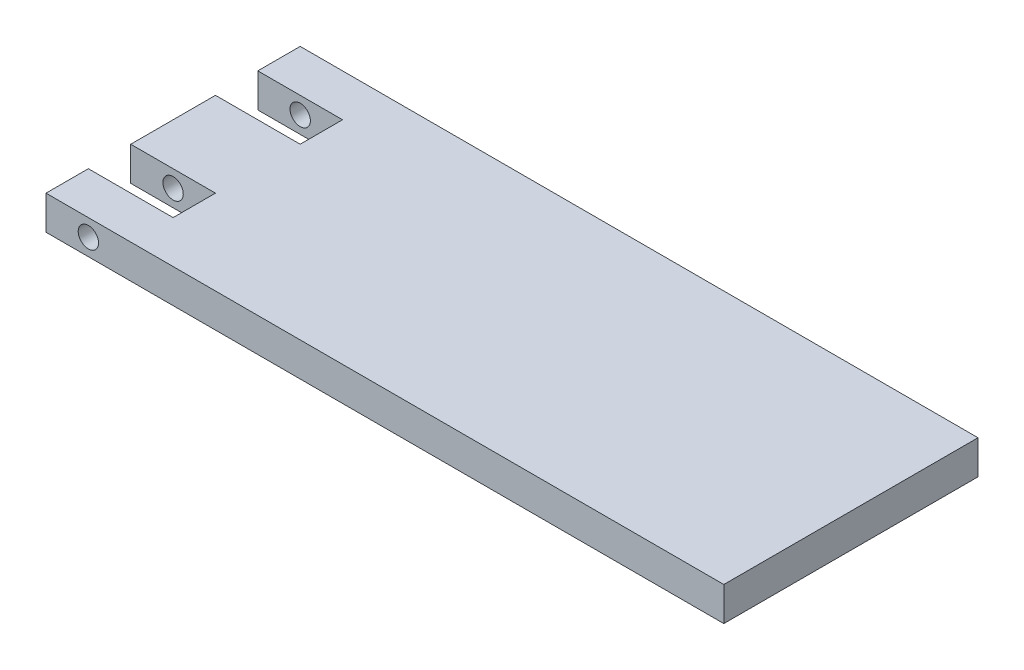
ISO-10303-21;
HEADER;
FILE_DESCRIPTION(('STEP AP214'),'2;1');
FILE_NAME('part.step','',(''),(''),'','','');
FILE_SCHEMA(('AUTOMOTIVE_DESIGN { 1 0 10303 214 1 1 1 1 }'));
ENDSEC;
DATA;
#1=APPLICATION_CONTEXT('core data for automotive mechanical design processes');
#2=APPLICATION_PROTOCOL_DEFINITION('international standard','automotive_design',2000,#1);
#3=PRODUCT_CONTEXT('',#1,'mechanical');
#4=PRODUCT('Part','Part','',(#3));
#5=PRODUCT_RELATED_PRODUCT_CATEGORY('part','',(#4));
#6=PRODUCT_DEFINITION_FORMATION('','',#4);
#7=PRODUCT_DEFINITION_CONTEXT('part definition',#1,'design');
#8=PRODUCT_DEFINITION('design','',#6,#7);
#9=PRODUCT_DEFINITION_SHAPE('','',#8);
#10=(LENGTH_UNIT() NAMED_UNIT(*) SI_UNIT(.MILLI.,.METRE.));
#11=(NAMED_UNIT(*) PLANE_ANGLE_UNIT() SI_UNIT($,.RADIAN.));
#12=(NAMED_UNIT(*) SI_UNIT($,.STERADIAN.) SOLID_ANGLE_UNIT());
#13=UNCERTAINTY_MEASURE_WITH_UNIT(LENGTH_MEASURE(1.E-05),#10,'distance_accuracy_value','');
#14=(GEOMETRIC_REPRESENTATION_CONTEXT(3) GLOBAL_UNCERTAINTY_ASSIGNED_CONTEXT((#13)) GLOBAL_UNIT_ASSIGNED_CONTEXT((#10,
#11,#12)) REPRESENTATION_CONTEXT('',''));
#15=CARTESIAN_POINT('',(0.,0.,0.));
#16=DIRECTION('',(0.,0.,1.));
#17=DIRECTION('',(1.,0.,0.));
#18=AXIS2_PLACEMENT_3D('',#15,#16,#17);
#19=CARTESIAN_POINT('',(0.,20.,-75.));
#20=DIRECTION('',(1.,0.,0.));
#21=DIRECTION('',(0.,0.,-1.));
#22=AXIS2_PLACEMENT_3D('',#19,#20,#21);
#23=PLANE('',#22);
#24=DIRECTION('',(0.,1.,0.));
#25=VECTOR('',#24,1.);
#26=CARTESIAN_POINT('',(0.,0.,25.));
#27=LINE('',#26,#25);
#28=CARTESIAN_POINT('',(0.,0.,25.));
#29=VERTEX_POINT('',#28);
#30=CARTESIAN_POINT('',(0.,20.,25.));
#31=VERTEX_POINT('',#30);
#32=EDGE_CURVE('E216',#29,#31,#27,.T.);
#33=ORIENTED_EDGE('',*,*,#32,.T.);
#34=DIRECTION('',(0.,0.,1.));
#35=VECTOR('',#34,1.);
#36=CARTESIAN_POINT('',(0.,20.,-75.));
#37=LINE('',#36,#35);
#38=CARTESIAN_POINT('',(0.,20.,-25.));
#39=VERTEX_POINT('',#38);
#40=EDGE_CURVE('E192',#39,#31,#37,.T.);
#41=ORIENTED_EDGE('',*,*,#40,.F.);
#42=DIRECTION('',(0.,1.,0.));
#43=VECTOR('',#42,1.);
#44=CARTESIAN_POINT('',(0.,0.,-25.));
#45=LINE('',#44,#43);
#46=CARTESIAN_POINT('',(0.,0.,-25.));
#47=VERTEX_POINT('',#46);
#48=EDGE_CURVE('E241',#47,#39,#45,.T.);
#49=ORIENTED_EDGE('',*,*,#48,.F.);
#50=DIRECTION('',(0.,0.,1.));
#51=VECTOR('',#50,1.);
#52=CARTESIAN_POINT('',(0.,0.,-75.));
#53=LINE('',#52,#51);
#54=EDGE_CURVE('E145',#47,#29,#53,.T.);
#55=ORIENTED_EDGE('',*,*,#54,.T.);
#56=EDGE_LOOP('',(#33,#41,#49,#55));
#57=FACE_BOUND('',#56,.T.);
#58=ADVANCED_FACE('F34',(#57),#23,.F.);
#59=DIRECTION('',(0.,1.,0.));
#60=VECTOR('',#59,1.);
#61=CARTESIAN_POINT('',(0.,0.,50.));
#62=LINE('',#61,#60);
#63=CARTESIAN_POINT('',(0.,0.,50.));
#64=VERTEX_POINT('',#63);
#65=CARTESIAN_POINT('',(0.,20.,50.));
#66=VERTEX_POINT('',#65);
#67=EDGE_CURVE('E124',#64,#66,#62,.T.);
#68=ORIENTED_EDGE('',*,*,#67,.F.);
#69=CARTESIAN_POINT('',(0.,0.,75.));
#70=VERTEX_POINT('',#69);
#71=EDGE_CURVE('E136',#64,#70,#53,.T.);
#72=ORIENTED_EDGE('',*,*,#71,.T.);
#73=DIRECTION('',(0.,-1.,0.));
#74=VECTOR('',#73,1.);
#75=CARTESIAN_POINT('',(0.,20.,75.));
#76=LINE('',#75,#74);
#77=CARTESIAN_POINT('',(0.,20.,75.));
#78=VERTEX_POINT('',#77);
#79=EDGE_CURVE('E11',#78,#70,#76,.T.);
#80=ORIENTED_EDGE('',*,*,#79,.F.);
#81=EDGE_CURVE('E138',#66,#78,#37,.T.);
#82=ORIENTED_EDGE('',*,*,#81,.F.);
#83=EDGE_LOOP('',(#68,#72,#80,#82));
#84=FACE_BOUND('',#83,.T.);
#85=ADVANCED_FACE('F134',(#84),#23,.F.);
#86=CARTESIAN_POINT('',(0.,20.,75.));
#87=DIRECTION('',(0.,1.,0.));
#88=DIRECTION('',(0.,0.,1.));
#89=AXIS2_PLACEMENT_3D('',#86,#87,#88);
#90=PLANE('',#89);
#91=ORIENTED_EDGE('',*,*,#40,.T.);
#92=DIRECTION('',(1.,0.,0.));
#93=VECTOR('',#92,1.);
#94=CARTESIAN_POINT('',(0.,20.,25.));
#95=LINE('',#94,#93);
#96=CARTESIAN_POINT('',(50.,20.,25.));
#97=VERTEX_POINT('',#96);
#98=EDGE_CURVE('E130',#31,#97,#95,.T.);
#99=ORIENTED_EDGE('',*,*,#98,.T.);
#100=DIRECTION('',(0.,0.,1.));
#101=VECTOR('',#100,1.);
#102=CARTESIAN_POINT('',(50.,20.,50.));
#103=LINE('',#102,#101);
#104=CARTESIAN_POINT('',(50.,20.,50.));
#105=VERTEX_POINT('',#104);
#106=EDGE_CURVE('E249',#97,#105,#103,.T.);
#107=ORIENTED_EDGE('',*,*,#106,.T.);
#108=DIRECTION('',(-1.,0.,0.));
#109=VECTOR('',#108,1.);
#110=CARTESIAN_POINT('',(0.,20.,50.));
#111=LINE('',#110,#109);
#112=EDGE_CURVE('E199',#105,#66,#111,.T.);
#113=ORIENTED_EDGE('',*,*,#112,.T.);
#114=ORIENTED_EDGE('',*,*,#81,.T.);
#115=DIRECTION('',(1.,0.,0.));
#116=VECTOR('',#115,1.);
#117=CARTESIAN_POINT('',(0.,20.,75.));
#118=LINE('',#117,#116);
#119=CARTESIAN_POINT('',(400.,20.,75.));
#120=VERTEX_POINT('',#119);
#121=EDGE_CURVE('E191',#78,#120,#118,.T.);
#122=ORIENTED_EDGE('',*,*,#121,.T.);
#123=DIRECTION('',(0.,0.,-1.));
#124=VECTOR('',#123,1.);
#125=CARTESIAN_POINT('',(400.,20.,-75.));
#126=LINE('',#125,#124);
#127=CARTESIAN_POINT('',(400.,20.,-75.));
#128=VERTEX_POINT('',#127);
#129=EDGE_CURVE('E177',#120,#128,#126,.T.);
#130=ORIENTED_EDGE('',*,*,#129,.T.);
#131=DIRECTION('',(-1.,0.,0.));
#132=VECTOR('',#131,1.);
#133=CARTESIAN_POINT('',(0.,20.,-75.));
#134=LINE('',#133,#132);
#135=CARTESIAN_POINT('',(0.,20.,-75.));
#136=VERTEX_POINT('',#135);
#137=EDGE_CURVE('E170',#128,#136,#134,.T.);
#138=ORIENTED_EDGE('',*,*,#137,.T.);
#139=CARTESIAN_POINT('',(0.,20.,-50.));
#140=VERTEX_POINT('',#139);
#141=EDGE_CURVE('E188',#136,#140,#37,.T.);
#142=ORIENTED_EDGE('',*,*,#141,.T.);
#143=DIRECTION('',(-1.,0.,0.));
#144=VECTOR('',#143,1.);
#145=CARTESIAN_POINT('',(0.,20.,-50.));
#146=LINE('',#145,#144);
#147=CARTESIAN_POINT('',(50.,20.,-50.));
#148=VERTEX_POINT('',#147);
#149=EDGE_CURVE('E231',#148,#140,#146,.T.);
#150=ORIENTED_EDGE('',*,*,#149,.F.);
#151=DIRECTION('',(0.,0.,-1.));
#152=VECTOR('',#151,1.);
#153=CARTESIAN_POINT('',(50.,20.,-50.));
#154=LINE('',#153,#152);
#155=CARTESIAN_POINT('',(50.,20.,-25.));
#156=VERTEX_POINT('',#155);
#157=EDGE_CURVE('E228',#156,#148,#154,.T.);
#158=ORIENTED_EDGE('',*,*,#157,.F.);
#159=DIRECTION('',(1.,0.,0.));
#160=VECTOR('',#159,1.);
#161=CARTESIAN_POINT('',(0.,20.,-25.));
#162=LINE('',#161,#160);
#163=EDGE_CURVE('E220',#39,#156,#162,.T.);
#164=ORIENTED_EDGE('',*,*,#163,.F.);
#165=EDGE_LOOP('',(#91,#99,#107,#113,#114,#122,#130,#138,#142,#150,#158,#164));
#166=FACE_BOUND('',#165,.T.);
#167=ADVANCED_FACE('F197',(#166),#90,.T.);
#168=CARTESIAN_POINT('',(0.,0.,75.));
#169=DIRECTION('',(0.,1.,0.));
#170=DIRECTION('',(0.,0.,1.));
#171=AXIS2_PLACEMENT_3D('',#168,#169,#170);
#172=PLANE('',#171);
#173=DIRECTION('',(1.,0.,0.));
#174=VECTOR('',#173,1.);
#175=CARTESIAN_POINT('',(0.,0.,25.));
#176=LINE('',#175,#174);
#177=CARTESIAN_POINT('',(50.,0.,25.));
#178=VERTEX_POINT('',#177);
#179=EDGE_CURVE('E139',#29,#178,#176,.T.);
#180=ORIENTED_EDGE('',*,*,#179,.F.);
#181=ORIENTED_EDGE('',*,*,#54,.F.);
#182=DIRECTION('',(1.,0.,0.));
#183=VECTOR('',#182,1.);
#184=CARTESIAN_POINT('',(0.,0.,-25.));
#185=LINE('',#184,#183);
#186=CARTESIAN_POINT('',(50.,0.,-25.));
#187=VERTEX_POINT('',#186);
#188=EDGE_CURVE('E237',#47,#187,#185,.T.);
#189=ORIENTED_EDGE('',*,*,#188,.T.);
#190=DIRECTION('',(0.,0.,-1.));
#191=VECTOR('',#190,1.);
#192=CARTESIAN_POINT('',(50.,0.,-50.));
#193=LINE('',#192,#191);
#194=CARTESIAN_POINT('',(50.,0.,-50.));
#195=VERTEX_POINT('',#194);
#196=EDGE_CURVE('E57',#187,#195,#193,.T.);
#197=ORIENTED_EDGE('',*,*,#196,.T.);
#198=DIRECTION('',(-1.,0.,0.));
#199=VECTOR('',#198,1.);
#200=CARTESIAN_POINT('',(0.,0.,-50.));
#201=LINE('',#200,#199);
#202=CARTESIAN_POINT('',(0.,0.,-50.));
#203=VERTEX_POINT('',#202);
#204=EDGE_CURVE('E234',#195,#203,#201,.T.);
#205=ORIENTED_EDGE('',*,*,#204,.T.);
#206=CARTESIAN_POINT('',(0.,0.,-75.));
#207=VERTEX_POINT('',#206);
#208=EDGE_CURVE('E148',#207,#203,#53,.T.);
#209=ORIENTED_EDGE('',*,*,#208,.F.);
#210=DIRECTION('',(-1.,0.,0.));
#211=VECTOR('',#210,1.);
#212=CARTESIAN_POINT('',(0.,0.,-75.));
#213=LINE('',#212,#211);
#214=CARTESIAN_POINT('',(400.,0.,-75.));
#215=VERTEX_POINT('',#214);
#216=EDGE_CURVE('E163',#215,#207,#213,.T.);
#217=ORIENTED_EDGE('',*,*,#216,.F.);
#218=DIRECTION('',(0.,0.,-1.));
#219=VECTOR('',#218,1.);
#220=CARTESIAN_POINT('',(400.,0.,-75.));
#221=LINE('',#220,#219);
#222=CARTESIAN_POINT('',(400.,0.,75.));
#223=VERTEX_POINT('',#222);
#224=EDGE_CURVE('E159',#223,#215,#221,.T.);
#225=ORIENTED_EDGE('',*,*,#224,.F.);
#226=DIRECTION('',(1.,0.,0.));
#227=VECTOR('',#226,1.);
#228=CARTESIAN_POINT('',(0.,0.,75.));
#229=LINE('',#228,#227);
#230=EDGE_CURVE('E144',#70,#223,#229,.T.);
#231=ORIENTED_EDGE('',*,*,#230,.F.);
#232=ORIENTED_EDGE('',*,*,#71,.F.);
#233=DIRECTION('',(-1.,0.,0.));
#234=VECTOR('',#233,1.);
#235=CARTESIAN_POINT('',(0.,0.,50.));
#236=LINE('',#235,#234);
#237=CARTESIAN_POINT('',(50.,0.,50.));
#238=VERTEX_POINT('',#237);
#239=EDGE_CURVE('E121',#238,#64,#236,.T.);
#240=ORIENTED_EDGE('',*,*,#239,.F.);
#241=DIRECTION('',(0.,0.,1.));
#242=VECTOR('',#241,1.);
#243=CARTESIAN_POINT('',(50.,0.,50.));
#244=LINE('',#243,#242);
#245=EDGE_CURVE('E129',#178,#238,#244,.T.);
#246=ORIENTED_EDGE('',*,*,#245,.F.);
#247=EDGE_LOOP('',(#180,#181,#189,#197,#205,#209,#217,#225,#231,#232,#240,#246));
#248=FACE_BOUND('',#247,.T.);
#249=ADVANCED_FACE('F142',(#248),#172,.F.);
#250=ORIENTED_EDGE('',*,*,#208,.T.);
#251=DIRECTION('',(0.,1.,0.));
#252=VECTOR('',#251,1.);
#253=CARTESIAN_POINT('',(0.,0.,-50.));
#254=LINE('',#253,#252);
#255=EDGE_CURVE('E146',#203,#140,#254,.T.);
#256=ORIENTED_EDGE('',*,*,#255,.T.);
#257=ORIENTED_EDGE('',*,*,#141,.F.);
#258=DIRECTION('',(0.,-1.,0.));
#259=VECTOR('',#258,1.);
#260=CARTESIAN_POINT('',(0.,20.,-75.));
#261=LINE('',#260,#259);
#262=EDGE_CURVE('E167',#136,#207,#261,.T.);
#263=ORIENTED_EDGE('',*,*,#262,.T.);
#264=EDGE_LOOP('',(#250,#256,#257,#263));
#265=FACE_BOUND('',#264,.T.);
#266=ADVANCED_FACE('F186',(#265),#23,.F.);
#267=CARTESIAN_POINT('',(0.,20.,75.));
#268=DIRECTION('',(0.,0.,-1.));
#269=DIRECTION('',(-1.,0.,0.));
#270=AXIS2_PLACEMENT_3D('',#267,#268,#269);
#271=PLANE('',#270);
#272=CARTESIAN_POINT('',(25.,10.,75.));
#273=DIRECTION('',(0.,0.,1.));
#274=DIRECTION('',(1.,0.,0.));
#275=AXIS2_PLACEMENT_3D('',#272,#273,#274);
#276=CIRCLE('',#275,6.);
#277=CARTESIAN_POINT('',(31.,10.,75.));
#278=VERTEX_POINT('',#277);
#279=EDGE_CURVE('E263',#278,#278,#276,.T.);
#280=ORIENTED_EDGE('',*,*,#279,.F.);
#281=EDGE_LOOP('',(#280));
#282=FACE_BOUND('',#281,.T.);
#283=ORIENTED_EDGE('',*,*,#230,.T.);
#284=DIRECTION('',(0.,-1.,0.));
#285=VECTOR('',#284,1.);
#286=CARTESIAN_POINT('',(400.,20.,75.));
#287=LINE('',#286,#285);
#288=EDGE_CURVE('E42',#120,#223,#287,.T.);
#289=ORIENTED_EDGE('',*,*,#288,.F.);
#290=ORIENTED_EDGE('',*,*,#121,.F.);
#291=ORIENTED_EDGE('',*,*,#79,.T.);
#292=EDGE_LOOP('',(#283,#289,#290,#291));
#293=FACE_BOUND('',#292,.T.);
#294=ADVANCED_FACE('F200',(#282,#293),#271,.F.);
#295=CARTESIAN_POINT('',(400.,20.,-75.));
#296=DIRECTION('',(-1.,0.,0.));
#297=DIRECTION('',(0.,0.,1.));
#298=AXIS2_PLACEMENT_3D('',#295,#296,#297);
#299=PLANE('',#298);
#300=ORIENTED_EDGE('',*,*,#224,.T.);
#301=DIRECTION('',(0.,-1.,0.));
#302=VECTOR('',#301,1.);
#303=CARTESIAN_POINT('',(400.,20.,-75.));
#304=LINE('',#303,#302);
#305=EDGE_CURVE('E169',#128,#215,#304,.T.);
#306=ORIENTED_EDGE('',*,*,#305,.F.);
#307=ORIENTED_EDGE('',*,*,#129,.F.);
#308=ORIENTED_EDGE('',*,*,#288,.T.);
#309=EDGE_LOOP('',(#300,#306,#307,#308));
#310=FACE_BOUND('',#309,.T.);
#311=ADVANCED_FACE('F175',(#310),#299,.F.);
#312=CARTESIAN_POINT('',(0.,20.,-75.));
#313=DIRECTION('',(0.,0.,1.));
#314=DIRECTION('',(1.,0.,0.));
#315=AXIS2_PLACEMENT_3D('',#312,#313,#314);
#316=PLANE('',#315);
#317=CARTESIAN_POINT('',(25.,10.,-75.));
#318=DIRECTION('',(0.,0.,1.));
#319=DIRECTION('',(1.,0.,0.));
#320=AXIS2_PLACEMENT_3D('',#317,#318,#319);
#321=CIRCLE('',#320,6.);
#322=CARTESIAN_POINT('',(31.,10.,-75.));
#323=VERTEX_POINT('',#322);
#324=EDGE_CURVE('E266',#323,#323,#321,.T.);
#325=ORIENTED_EDGE('',*,*,#324,.T.);
#326=EDGE_LOOP('',(#325));
#327=FACE_BOUND('',#326,.T.);
#328=ORIENTED_EDGE('',*,*,#216,.T.);
#329=ORIENTED_EDGE('',*,*,#262,.F.);
#330=ORIENTED_EDGE('',*,*,#137,.F.);
#331=ORIENTED_EDGE('',*,*,#305,.T.);
#332=EDGE_LOOP('',(#328,#329,#330,#331));
#333=FACE_BOUND('',#332,.T.);
#334=ADVANCED_FACE('F183',(#327,#333),#316,.F.);
#335=CARTESIAN_POINT('',(0.,0.,-50.));
#336=DIRECTION('',(0.,0.,-1.));
#337=DIRECTION('',(-1.,0.,0.));
#338=AXIS2_PLACEMENT_3D('',#335,#336,#337);
#339=PLANE('',#338);
#340=CARTESIAN_POINT('',(25.,10.,-50.));
#341=DIRECTION('',(0.,0.,-1.));
#342=DIRECTION('',(-1.,0.,0.));
#343=AXIS2_PLACEMENT_3D('',#340,#341,#342);
#344=CIRCLE('',#343,6.);
#345=CARTESIAN_POINT('',(19.,10.,-50.));
#346=VERTEX_POINT('',#345);
#347=EDGE_CURVE('E252',#346,#346,#344,.T.);
#348=ORIENTED_EDGE('',*,*,#347,.T.);
#349=EDGE_LOOP('',(#348));
#350=FACE_BOUND('',#349,.T.);
#351=ORIENTED_EDGE('',*,*,#149,.T.);
#352=ORIENTED_EDGE('',*,*,#255,.F.);
#353=ORIENTED_EDGE('',*,*,#204,.F.);
#354=DIRECTION('',(0.,1.,0.));
#355=VECTOR('',#354,1.);
#356=CARTESIAN_POINT('',(50.,0.,-50.));
#357=LINE('',#356,#355);
#358=EDGE_CURVE('E151',#195,#148,#357,.T.);
#359=ORIENTED_EDGE('',*,*,#358,.T.);
#360=EDGE_LOOP('',(#351,#352,#353,#359));
#361=FACE_BOUND('',#360,.T.);
#362=ADVANCED_FACE('F291',(#350,#361),#339,.F.);
#363=CARTESIAN_POINT('',(50.,0.,-50.));
#364=DIRECTION('',(1.,0.,0.));
#365=DIRECTION('',(0.,0.,-1.));
#366=AXIS2_PLACEMENT_3D('',#363,#364,#365);
#367=PLANE('',#366);
#368=ORIENTED_EDGE('',*,*,#157,.T.);
#369=ORIENTED_EDGE('',*,*,#358,.F.);
#370=ORIENTED_EDGE('',*,*,#196,.F.);
#371=DIRECTION('',(0.,1.,0.));
#372=VECTOR('',#371,1.);
#373=CARTESIAN_POINT('',(50.,0.,-25.));
#374=LINE('',#373,#372);
#375=EDGE_CURVE('E240',#187,#156,#374,.T.);
#376=ORIENTED_EDGE('',*,*,#375,.T.);
#377=EDGE_LOOP('',(#368,#369,#370,#376));
#378=FACE_BOUND('',#377,.T.);
#379=ADVANCED_FACE('F294',(#378),#367,.F.);
#380=CARTESIAN_POINT('',(0.,0.,-25.));
#381=DIRECTION('',(0.,0.,1.));
#382=DIRECTION('',(1.,0.,0.));
#383=AXIS2_PLACEMENT_3D('',#380,#381,#382);
#384=PLANE('',#383);
#385=CARTESIAN_POINT('',(25.,10.,-25.));
#386=DIRECTION('',(0.,0.,1.));
#387=DIRECTION('',(1.,0.,0.));
#388=AXIS2_PLACEMENT_3D('',#385,#386,#387);
#389=CIRCLE('',#388,6.);
#390=CARTESIAN_POINT('',(31.,10.,-25.));
#391=VERTEX_POINT('',#390);
#392=EDGE_CURVE('E257',#391,#391,#389,.T.);
#393=ORIENTED_EDGE('',*,*,#392,.T.);
#394=EDGE_LOOP('',(#393));
#395=FACE_BOUND('',#394,.T.);
#396=ORIENTED_EDGE('',*,*,#163,.T.);
#397=ORIENTED_EDGE('',*,*,#375,.F.);
#398=ORIENTED_EDGE('',*,*,#188,.F.);
#399=ORIENTED_EDGE('',*,*,#48,.T.);
#400=EDGE_LOOP('',(#396,#397,#398,#399));
#401=FACE_BOUND('',#400,.T.);
#402=ADVANCED_FACE('F298',(#395,#401),#384,.F.);
#403=CARTESIAN_POINT('',(0.,0.,25.));
#404=DIRECTION('',(0.,0.,1.));
#405=DIRECTION('',(1.,0.,0.));
#406=AXIS2_PLACEMENT_3D('',#403,#404,#405);
#407=PLANE('',#406);
#408=CARTESIAN_POINT('',(25.,10.,25.));
#409=DIRECTION('',(0.,0.,1.));
#410=DIRECTION('',(1.,0.,0.));
#411=AXIS2_PLACEMENT_3D('',#408,#409,#410);
#412=CIRCLE('',#411,6.);
#413=CARTESIAN_POINT('',(31.,10.,25.));
#414=VERTEX_POINT('',#413);
#415=EDGE_CURVE('E260',#414,#414,#412,.T.);
#416=ORIENTED_EDGE('',*,*,#415,.F.);
#417=EDGE_LOOP('',(#416));
#418=FACE_BOUND('',#417,.T.);
#419=ORIENTED_EDGE('',*,*,#98,.F.);
#420=ORIENTED_EDGE('',*,*,#32,.F.);
#421=ORIENTED_EDGE('',*,*,#179,.T.);
#422=DIRECTION('',(0.,1.,0.));
#423=VECTOR('',#422,1.);
#424=CARTESIAN_POINT('',(50.,0.,25.));
#425=LINE('',#424,#423);
#426=EDGE_CURVE('E221',#178,#97,#425,.T.);
#427=ORIENTED_EDGE('',*,*,#426,.T.);
#428=EDGE_LOOP('',(#419,#420,#421,#427));
#429=FACE_BOUND('',#428,.T.);
#430=ADVANCED_FACE('F286',(#418,#429),#407,.T.);
#431=CARTESIAN_POINT('',(50.,0.,50.));
#432=DIRECTION('',(-1.,0.,0.));
#433=DIRECTION('',(0.,0.,1.));
#434=AXIS2_PLACEMENT_3D('',#431,#432,#433);
#435=PLANE('',#434);
#436=ORIENTED_EDGE('',*,*,#106,.F.);
#437=ORIENTED_EDGE('',*,*,#426,.F.);
#438=ORIENTED_EDGE('',*,*,#245,.T.);
#439=DIRECTION('',(0.,1.,0.));
#440=VECTOR('',#439,1.);
#441=CARTESIAN_POINT('',(50.,0.,50.));
#442=LINE('',#441,#440);
#443=EDGE_CURVE('E49',#238,#105,#442,.T.);
#444=ORIENTED_EDGE('',*,*,#443,.T.);
#445=EDGE_LOOP('',(#436,#437,#438,#444));
#446=FACE_BOUND('',#445,.T.);
#447=ADVANCED_FACE('F277',(#446),#435,.T.);
#448=CARTESIAN_POINT('',(0.,0.,50.));
#449=DIRECTION('',(0.,0.,-1.));
#450=DIRECTION('',(-1.,0.,0.));
#451=AXIS2_PLACEMENT_3D('',#448,#449,#450);
#452=PLANE('',#451);
#453=CARTESIAN_POINT('',(25.,10.,50.));
#454=DIRECTION('',(0.,0.,-1.));
#455=DIRECTION('',(-1.,0.,0.));
#456=AXIS2_PLACEMENT_3D('',#453,#454,#455);
#457=CIRCLE('',#456,6.);
#458=CARTESIAN_POINT('',(19.,10.,50.));
#459=VERTEX_POINT('',#458);
#460=EDGE_CURVE('E37',#459,#459,#457,.T.);
#461=ORIENTED_EDGE('',*,*,#460,.F.);
#462=EDGE_LOOP('',(#461));
#463=FACE_BOUND('',#462,.T.);
#464=ORIENTED_EDGE('',*,*,#112,.F.);
#465=ORIENTED_EDGE('',*,*,#443,.F.);
#466=ORIENTED_EDGE('',*,*,#239,.T.);
#467=ORIENTED_EDGE('',*,*,#67,.T.);
#468=EDGE_LOOP('',(#464,#465,#466,#467));
#469=FACE_BOUND('',#468,.T.);
#470=ADVANCED_FACE('F123',(#463,#469),#452,.T.);
#471=CARTESIAN_POINT('',(25.,10.,-75.));
#472=DIRECTION('',(0.,0.,1.));
#473=DIRECTION('',(1.,0.,0.));
#474=AXIS2_PLACEMENT_3D('',#471,#472,#473);
#475=CYLINDRICAL_SURFACE('',#474,6.);
#476=ORIENTED_EDGE('',*,*,#460,.T.);
#477=EDGE_LOOP('',(#476));
#478=FACE_BOUND('',#477,.T.);
#479=ORIENTED_EDGE('',*,*,#279,.T.);
#480=EDGE_LOOP('',(#479));
#481=FACE_BOUND('',#480,.T.);
#482=ADVANCED_FACE('F273',(#478,#481),#475,.F.);
#483=ORIENTED_EDGE('',*,*,#415,.T.);
#484=EDGE_LOOP('',(#483));
#485=FACE_BOUND('',#484,.T.);
#486=ORIENTED_EDGE('',*,*,#392,.F.);
#487=EDGE_LOOP('',(#486));
#488=FACE_BOUND('',#487,.T.);
#489=ADVANCED_FACE('F283',(#485,#488),#475,.F.);
#490=ORIENTED_EDGE('',*,*,#324,.F.);
#491=EDGE_LOOP('',(#490));
#492=FACE_BOUND('',#491,.T.);
#493=ORIENTED_EDGE('',*,*,#347,.F.);
#494=EDGE_LOOP('',(#493));
#495=FACE_BOUND('',#494,.T.);
#496=ADVANCED_FACE('F285',(#492,#495),#475,.F.);
#497=CLOSED_SHELL('',(#58,#85,#167,#249,#266,#294,#311,#334,#362,#379,#402,#430,#447,#470,#482,
#489,#496));
#498=MANIFOLD_SOLID_BREP('B2',#497);
#499=ADVANCED_BREP_SHAPE_REPRESENTATION('',(#18,#498),#14);
#500=SHAPE_DEFINITION_REPRESENTATION(#9,#499);
ENDSEC;
END-ISO-10303-21;
